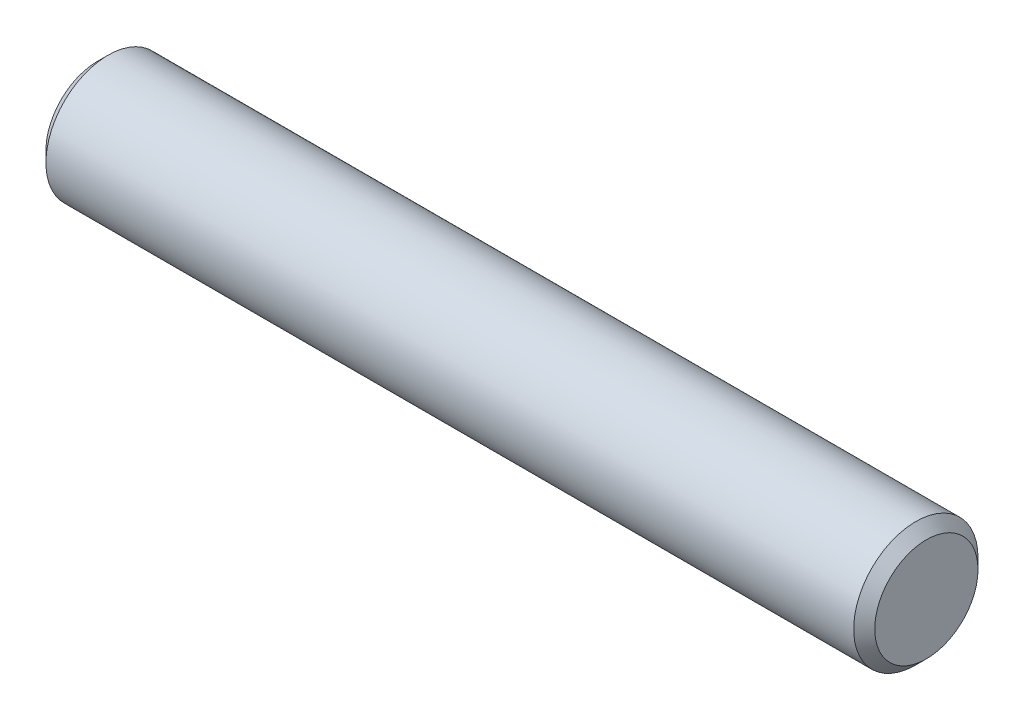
ISO-10303-21;
HEADER;
FILE_DESCRIPTION(('STEP AP214'),'2;1');
FILE_NAME('part.step','',(''),(''),'','','');
FILE_SCHEMA(('AUTOMOTIVE_DESIGN { 1 0 10303 214 1 1 1 1 }'));
ENDSEC;
DATA;
#1=APPLICATION_CONTEXT('core data for automotive mechanical design processes');
#2=APPLICATION_PROTOCOL_DEFINITION('international standard','automotive_design',2000,#1);
#3=PRODUCT_CONTEXT('',#1,'mechanical');
#4=PRODUCT('Part','Part','',(#3));
#5=PRODUCT_RELATED_PRODUCT_CATEGORY('part','',(#4));
#6=PRODUCT_DEFINITION_FORMATION('','',#4);
#7=PRODUCT_DEFINITION_CONTEXT('part definition',#1,'design');
#8=PRODUCT_DEFINITION('design','',#6,#7);
#9=PRODUCT_DEFINITION_SHAPE('','',#8);
#10=(LENGTH_UNIT() NAMED_UNIT(*) SI_UNIT(.MILLI.,.METRE.));
#11=(NAMED_UNIT(*) PLANE_ANGLE_UNIT() SI_UNIT($,.RADIAN.));
#12=(NAMED_UNIT(*) SI_UNIT($,.STERADIAN.) SOLID_ANGLE_UNIT());
#13=UNCERTAINTY_MEASURE_WITH_UNIT(LENGTH_MEASURE(1.E-05),#10,'distance_accuracy_value','');
#14=(GEOMETRIC_REPRESENTATION_CONTEXT(3) GLOBAL_UNCERTAINTY_ASSIGNED_CONTEXT((#13)) GLOBAL_UNIT_ASSIGNED_CONTEXT((#10,
#11,#12)) REPRESENTATION_CONTEXT('',''));
#15=CARTESIAN_POINT('',(0.,0.,0.));
#16=DIRECTION('',(0.,0.,1.));
#17=DIRECTION('',(1.,0.,0.));
#18=AXIS2_PLACEMENT_3D('',#15,#16,#17);
#19=CARTESIAN_POINT('',(10.,0.,0.));
#20=DIRECTION('',(-1.,0.,0.));
#21=DIRECTION('',(0.,0.,1.));
#22=AXIS2_PLACEMENT_3D('',#19,#20,#21);
#23=CYLINDRICAL_SURFACE('',#22,1.5);
#24=CARTESIAN_POINT('',(9.746,0.,0.));
#25=DIRECTION('',(1.,0.,0.));
#26=DIRECTION('',(0.,0.,-1.));
#27=AXIS2_PLACEMENT_3D('',#24,#25,#26);
#28=CIRCLE('',#27,1.5);
#29=CARTESIAN_POINT('',(9.746,0.,-1.5));
#30=VERTEX_POINT('',#29);
#31=EDGE_CURVE('E44',#30,#30,#28,.F.);
#32=ORIENTED_EDGE('',*,*,#31,.T.);
#33=EDGE_LOOP('',(#32));
#34=FACE_BOUND('',#33,.T.);
#35=CARTESIAN_POINT('',(-9.746,0.,0.));
#36=DIRECTION('',(1.,0.,0.));
#37=DIRECTION('',(0.,0.,-1.));
#38=AXIS2_PLACEMENT_3D('',#35,#36,#37);
#39=CIRCLE('',#38,1.5);
#40=CARTESIAN_POINT('',(-9.746,0.,-1.5));
#41=VERTEX_POINT('',#40);
#42=EDGE_CURVE('E48',#41,#41,#39,.T.);
#43=ORIENTED_EDGE('',*,*,#42,.T.);
#44=EDGE_LOOP('',(#43));
#45=FACE_BOUND('',#44,.T.);
#46=ADVANCED_FACE('F37',(#34,#45),#23,.T.);
#47=CARTESIAN_POINT('',(10.,0.,0.));
#48=DIRECTION('',(1.,0.,0.));
#49=DIRECTION('',(0.,0.,-1.));
#50=AXIS2_PLACEMENT_3D('',#47,#48,#49);
#51=PLANE('',#50);
#52=CARTESIAN_POINT('',(10.,0.,0.));
#53=DIRECTION('',(1.,0.,0.));
#54=DIRECTION('',(0.,0.,-1.));
#55=AXIS2_PLACEMENT_3D('',#52,#53,#54);
#56=CIRCLE('',#55,1.246);
#57=CARTESIAN_POINT('',(10.,0.,-1.246));
#58=VERTEX_POINT('',#57);
#59=EDGE_CURVE('E52',#58,#58,#56,.T.);
#60=ORIENTED_EDGE('',*,*,#59,.T.);
#61=EDGE_LOOP('',(#60));
#62=FACE_BOUND('',#61,.T.);
#63=ADVANCED_FACE('F58',(#62),#51,.T.);
#64=CARTESIAN_POINT('',(-10.,0.,0.));
#65=DIRECTION('',(1.,0.,0.));
#66=DIRECTION('',(0.,0.,-1.));
#67=AXIS2_PLACEMENT_3D('',#64,#65,#66);
#68=PLANE('',#67);
#69=CARTESIAN_POINT('',(-10.,0.,0.));
#70=DIRECTION('',(1.,0.,0.));
#71=DIRECTION('',(0.,0.,-1.));
#72=AXIS2_PLACEMENT_3D('',#69,#70,#71);
#73=CIRCLE('',#72,1.246);
#74=CARTESIAN_POINT('',(-10.,0.,-1.246));
#75=VERTEX_POINT('',#74);
#76=EDGE_CURVE('E10',#75,#75,#73,.F.);
#77=ORIENTED_EDGE('',*,*,#76,.T.);
#78=EDGE_LOOP('',(#77));
#79=FACE_BOUND('',#78,.T.);
#80=ADVANCED_FACE('F62',(#79),#68,.F.);
#81=CARTESIAN_POINT('',(10.,0.,0.));
#82=DIRECTION('',(-1.,0.,0.));
#83=DIRECTION('',(0.,0.,1.));
#84=AXIS2_PLACEMENT_3D('',#81,#82,#83);
#85=CONICAL_SURFACE('',#84,1.246,0.785398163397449);
#86=ORIENTED_EDGE('',*,*,#31,.F.);
#87=EDGE_LOOP('',(#86));
#88=FACE_BOUND('',#87,.T.);
#89=ORIENTED_EDGE('',*,*,#59,.F.);
#90=EDGE_LOOP('',(#89));
#91=FACE_BOUND('',#90,.T.);
#92=ADVANCED_FACE('F60',(#88,#91),#85,.T.);
#93=CARTESIAN_POINT('',(-9.746,0.,0.));
#94=DIRECTION('',(1.,0.,0.));
#95=DIRECTION('',(0.,0.,-1.));
#96=AXIS2_PLACEMENT_3D('',#93,#94,#95);
#97=CONICAL_SURFACE('',#96,1.5,0.78539816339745);
#98=ORIENTED_EDGE('',*,*,#76,.F.);
#99=EDGE_LOOP('',(#98));
#100=FACE_BOUND('',#99,.T.);
#101=ORIENTED_EDGE('',*,*,#42,.F.);
#102=EDGE_LOOP('',(#101));
#103=FACE_BOUND('',#102,.T.);
#104=ADVANCED_FACE('F39',(#100,#103),#97,.T.);
#105=CLOSED_SHELL('',(#46,#63,#80,#92,#104));
#106=MANIFOLD_SOLID_BREP('B2',#105);
#107=ADVANCED_BREP_SHAPE_REPRESENTATION('',(#18,#106),#14);
#108=SHAPE_DEFINITION_REPRESENTATION(#9,#107);
ENDSEC;
END-ISO-10303-21;
